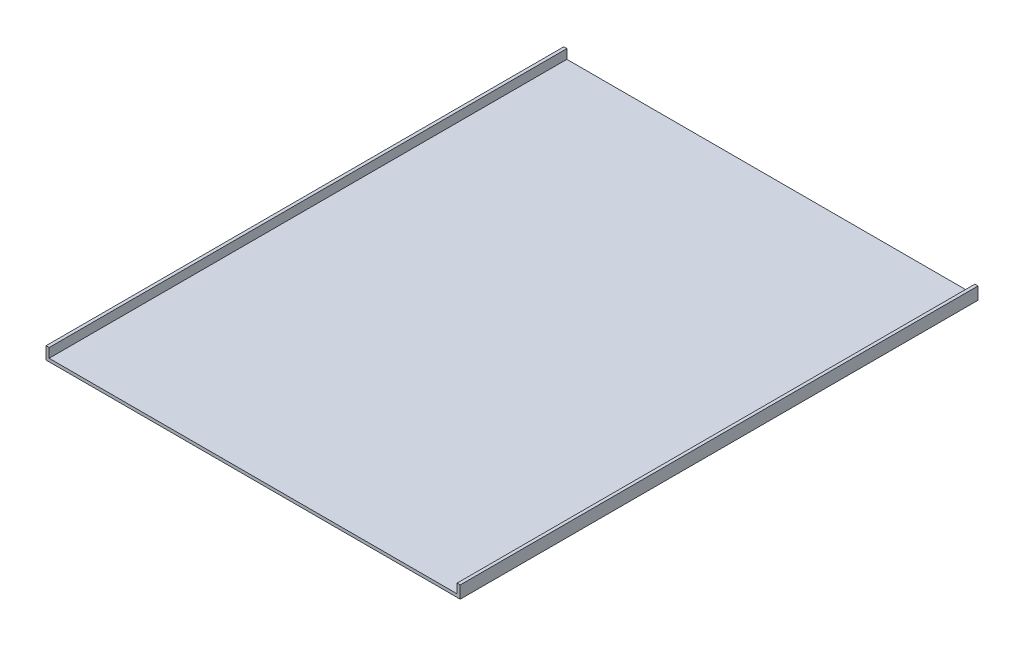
ISO-10303-21;
HEADER;
FILE_DESCRIPTION(('STEP AP214'),'2;1');
FILE_NAME('part.step','',(''),(''),'','','');
FILE_SCHEMA(('AUTOMOTIVE_DESIGN { 1 0 10303 214 1 1 1 1 }'));
ENDSEC;
DATA;
#1=APPLICATION_CONTEXT('core data for automotive mechanical design processes');
#2=APPLICATION_PROTOCOL_DEFINITION('international standard','automotive_design',2000,#1);
#3=PRODUCT_CONTEXT('',#1,'mechanical');
#4=PRODUCT('Part','Part','',(#3));
#5=PRODUCT_RELATED_PRODUCT_CATEGORY('part','',(#4));
#6=PRODUCT_DEFINITION_FORMATION('','',#4);
#7=PRODUCT_DEFINITION_CONTEXT('part definition',#1,'design');
#8=PRODUCT_DEFINITION('design','',#6,#7);
#9=PRODUCT_DEFINITION_SHAPE('','',#8);
#10=(LENGTH_UNIT() NAMED_UNIT(*) SI_UNIT(.MILLI.,.METRE.));
#11=(NAMED_UNIT(*) PLANE_ANGLE_UNIT() SI_UNIT($,.RADIAN.));
#12=(NAMED_UNIT(*) SI_UNIT($,.STERADIAN.) SOLID_ANGLE_UNIT());
#13=UNCERTAINTY_MEASURE_WITH_UNIT(LENGTH_MEASURE(1.E-05),#10,'distance_accuracy_value','');
#14=(GEOMETRIC_REPRESENTATION_CONTEXT(3) GLOBAL_UNCERTAINTY_ASSIGNED_CONTEXT((#13)) GLOBAL_UNIT_ASSIGNED_CONTEXT((#10,
#11,#12)) REPRESENTATION_CONTEXT('',''));
#15=CARTESIAN_POINT('',(0.,0.,0.));
#16=DIRECTION('',(0.,0.,1.));
#17=DIRECTION('',(1.,0.,0.));
#18=AXIS2_PLACEMENT_3D('',#15,#16,#17);
#19=CARTESIAN_POINT('',(400.,0.,500.));
#20=DIRECTION('',(-1.,0.,0.));
#21=DIRECTION('',(0.,0.,1.));
#22=AXIS2_PLACEMENT_3D('',#19,#20,#21);
#23=PLANE('',#22);
#24=DIRECTION('',(0.,1.,0.));
#25=VECTOR('',#24,1.);
#26=CARTESIAN_POINT('',(400.,0.,0.));
#27=LINE('',#26,#25);
#28=CARTESIAN_POINT('',(400.,0.,0.));
#29=VERTEX_POINT('',#28);
#30=CARTESIAN_POINT('',(400.,12.,0.));
#31=VERTEX_POINT('',#30);
#32=EDGE_CURVE('E128',#29,#31,#27,.T.);
#33=ORIENTED_EDGE('',*,*,#32,.T.);
#34=DIRECTION('',(0.,0.,-1.));
#35=VECTOR('',#34,1.);
#36=CARTESIAN_POINT('',(400.,12.,500.));
#37=LINE('',#36,#35);
#38=CARTESIAN_POINT('',(400.,12.,500.));
#39=VERTEX_POINT('',#38);
#40=EDGE_CURVE('E11',#39,#31,#37,.T.);
#41=ORIENTED_EDGE('',*,*,#40,.F.);
#42=DIRECTION('',(0.,1.,0.));
#43=VECTOR('',#42,1.);
#44=CARTESIAN_POINT('',(400.,0.,500.));
#45=LINE('',#44,#43);
#46=CARTESIAN_POINT('',(400.,0.,500.));
#47=VERTEX_POINT('',#46);
#48=EDGE_CURVE('E86',#47,#39,#45,.T.);
#49=ORIENTED_EDGE('',*,*,#48,.F.);
#50=DIRECTION('',(0.,0.,-1.));
#51=VECTOR('',#50,1.);
#52=CARTESIAN_POINT('',(400.,0.,500.));
#53=LINE('',#52,#51);
#54=EDGE_CURVE('E127',#47,#29,#53,.T.);
#55=ORIENTED_EDGE('',*,*,#54,.T.);
#56=EDGE_LOOP('',(#33,#41,#49,#55));
#57=FACE_BOUND('',#56,.T.);
#58=ADVANCED_FACE('F31',(#57),#23,.F.);
#59=CARTESIAN_POINT('',(397.,12.,500.));
#60=DIRECTION('',(0.,1.,0.));
#61=DIRECTION('',(0.,0.,1.));
#62=AXIS2_PLACEMENT_3D('',#59,#60,#61);
#63=PLANE('',#62);
#64=DIRECTION('',(1.,0.,0.));
#65=VECTOR('',#64,1.);
#66=CARTESIAN_POINT('',(397.,12.,0.));
#67=LINE('',#66,#65);
#68=CARTESIAN_POINT('',(397.,12.,0.));
#69=VERTEX_POINT('',#68);
#70=EDGE_CURVE('E131',#69,#31,#67,.T.);
#71=ORIENTED_EDGE('',*,*,#70,.F.);
#72=DIRECTION('',(0.,0.,-1.));
#73=VECTOR('',#72,1.);
#74=CARTESIAN_POINT('',(397.,12.,500.));
#75=LINE('',#74,#73);
#76=CARTESIAN_POINT('',(397.,12.,500.));
#77=VERTEX_POINT('',#76);
#78=EDGE_CURVE('E39',#77,#69,#75,.T.);
#79=ORIENTED_EDGE('',*,*,#78,.F.);
#80=DIRECTION('',(1.,0.,0.));
#81=VECTOR('',#80,1.);
#82=CARTESIAN_POINT('',(397.,12.,500.));
#83=LINE('',#82,#81);
#84=EDGE_CURVE('E170',#77,#39,#83,.T.);
#85=ORIENTED_EDGE('',*,*,#84,.T.);
#86=ORIENTED_EDGE('',*,*,#40,.T.);
#87=EDGE_LOOP('',(#71,#79,#85,#86));
#88=FACE_BOUND('',#87,.T.);
#89=ADVANCED_FACE('F161',(#88),#63,.T.);
#90=CARTESIAN_POINT('',(397.,0.,500.));
#91=DIRECTION('',(-1.,0.,0.));
#92=DIRECTION('',(0.,0.,1.));
#93=AXIS2_PLACEMENT_3D('',#90,#91,#92);
#94=PLANE('',#93);
#95=DIRECTION('',(0.,1.,0.));
#96=VECTOR('',#95,1.);
#97=CARTESIAN_POINT('',(397.,0.,0.));
#98=LINE('',#97,#96);
#99=CARTESIAN_POINT('',(397.,3.,0.));
#100=VERTEX_POINT('',#99);
#101=EDGE_CURVE('E134',#100,#69,#98,.T.);
#102=ORIENTED_EDGE('',*,*,#101,.F.);
#103=DIRECTION('',(0.,0.,-1.));
#104=VECTOR('',#103,1.);
#105=CARTESIAN_POINT('',(397.,3.,500.));
#106=LINE('',#105,#104);
#107=CARTESIAN_POINT('',(397.,3.,500.));
#108=VERTEX_POINT('',#107);
#109=EDGE_CURVE('E151',#108,#100,#106,.T.);
#110=ORIENTED_EDGE('',*,*,#109,.F.);
#111=DIRECTION('',(0.,1.,0.));
#112=VECTOR('',#111,1.);
#113=CARTESIAN_POINT('',(397.,0.,500.));
#114=LINE('',#113,#112);
#115=EDGE_CURVE('E158',#108,#77,#114,.T.);
#116=ORIENTED_EDGE('',*,*,#115,.T.);
#117=ORIENTED_EDGE('',*,*,#78,.T.);
#118=EDGE_LOOP('',(#102,#110,#116,#117));
#119=FACE_BOUND('',#118,.T.);
#120=ADVANCED_FACE('F156',(#119),#94,.T.);
#121=CARTESIAN_POINT('',(0.,3.,500.));
#122=DIRECTION('',(0.,1.,0.));
#123=DIRECTION('',(0.,0.,1.));
#124=AXIS2_PLACEMENT_3D('',#121,#122,#123);
#125=PLANE('',#124);
#126=DIRECTION('',(1.,0.,0.));
#127=VECTOR('',#126,1.);
#128=CARTESIAN_POINT('',(0.,3.,0.));
#129=LINE('',#128,#127);
#130=CARTESIAN_POINT('',(3.,3.,0.));
#131=VERTEX_POINT('',#130);
#132=EDGE_CURVE('E137',#131,#100,#129,.T.);
#133=ORIENTED_EDGE('',*,*,#132,.F.);
#134=DIRECTION('',(0.,0.,-1.));
#135=VECTOR('',#134,1.);
#136=CARTESIAN_POINT('',(3.,3.,500.));
#137=LINE('',#136,#135);
#138=CARTESIAN_POINT('',(3.,3.,500.));
#139=VERTEX_POINT('',#138);
#140=EDGE_CURVE('E149',#139,#131,#137,.T.);
#141=ORIENTED_EDGE('',*,*,#140,.F.);
#142=DIRECTION('',(1.,0.,0.));
#143=VECTOR('',#142,1.);
#144=CARTESIAN_POINT('',(0.,3.,500.));
#145=LINE('',#144,#143);
#146=EDGE_CURVE('E122',#139,#108,#145,.T.);
#147=ORIENTED_EDGE('',*,*,#146,.T.);
#148=ORIENTED_EDGE('',*,*,#109,.T.);
#149=EDGE_LOOP('',(#133,#141,#147,#148));
#150=FACE_BOUND('',#149,.T.);
#151=ADVANCED_FACE('F168',(#150),#125,.T.);
#152=CARTESIAN_POINT('',(3.,12.,500.));
#153=DIRECTION('',(1.,0.,0.));
#154=DIRECTION('',(0.,1.,0.));
#155=AXIS2_PLACEMENT_3D('',#152,#153,#154);
#156=PLANE('',#155);
#157=DIRECTION('',(0.,-1.,0.));
#158=VECTOR('',#157,1.);
#159=CARTESIAN_POINT('',(3.,12.,0.));
#160=LINE('',#159,#158);
#161=CARTESIAN_POINT('',(3.,12.,0.));
#162=VERTEX_POINT('',#161);
#163=EDGE_CURVE('E140',#162,#131,#160,.T.);
#164=ORIENTED_EDGE('',*,*,#163,.F.);
#165=DIRECTION('',(0.,0.,-1.));
#166=VECTOR('',#165,1.);
#167=CARTESIAN_POINT('',(3.,12.,500.));
#168=LINE('',#167,#166);
#169=CARTESIAN_POINT('',(3.,12.,500.));
#170=VERTEX_POINT('',#169);
#171=EDGE_CURVE('E110',#170,#162,#168,.T.);
#172=ORIENTED_EDGE('',*,*,#171,.F.);
#173=DIRECTION('',(0.,-1.,0.));
#174=VECTOR('',#173,1.);
#175=CARTESIAN_POINT('',(3.,12.,500.));
#176=LINE('',#175,#174);
#177=EDGE_CURVE('E120',#170,#139,#176,.T.);
#178=ORIENTED_EDGE('',*,*,#177,.T.);
#179=ORIENTED_EDGE('',*,*,#140,.T.);
#180=EDGE_LOOP('',(#164,#172,#178,#179));
#181=FACE_BOUND('',#180,.T.);
#182=ADVANCED_FACE('F175',(#181),#156,.T.);
#183=CARTESIAN_POINT('',(0.,12.,500.));
#184=DIRECTION('',(0.,1.,0.));
#185=DIRECTION('',(0.,0.,1.));
#186=AXIS2_PLACEMENT_3D('',#183,#184,#185);
#187=PLANE('',#186);
#188=DIRECTION('',(1.,0.,0.));
#189=VECTOR('',#188,1.);
#190=CARTESIAN_POINT('',(0.,12.,0.));
#191=LINE('',#190,#189);
#192=CARTESIAN_POINT('',(0.,12.,0.));
#193=VERTEX_POINT('',#192);
#194=EDGE_CURVE('E109',#193,#162,#191,.T.);
#195=ORIENTED_EDGE('',*,*,#194,.F.);
#196=DIRECTION('',(0.,0.,-1.));
#197=VECTOR('',#196,1.);
#198=CARTESIAN_POINT('',(0.,12.,500.));
#199=LINE('',#198,#197);
#200=CARTESIAN_POINT('',(0.,12.,500.));
#201=VERTEX_POINT('',#200);
#202=EDGE_CURVE('E103',#201,#193,#199,.T.);
#203=ORIENTED_EDGE('',*,*,#202,.F.);
#204=DIRECTION('',(1.,0.,0.));
#205=VECTOR('',#204,1.);
#206=CARTESIAN_POINT('',(0.,12.,500.));
#207=LINE('',#206,#205);
#208=EDGE_CURVE('E107',#201,#170,#207,.T.);
#209=ORIENTED_EDGE('',*,*,#208,.T.);
#210=ORIENTED_EDGE('',*,*,#171,.T.);
#211=EDGE_LOOP('',(#195,#203,#209,#210));
#212=FACE_BOUND('',#211,.T.);
#213=ADVANCED_FACE('F105',(#212),#187,.T.);
#214=CARTESIAN_POINT('',(0.,12.,500.));
#215=DIRECTION('',(1.,0.,0.));
#216=DIRECTION('',(0.,1.,0.));
#217=AXIS2_PLACEMENT_3D('',#214,#215,#216);
#218=PLANE('',#217);
#219=DIRECTION('',(0.,-1.,0.));
#220=VECTOR('',#219,1.);
#221=CARTESIAN_POINT('',(0.,12.,0.));
#222=LINE('',#221,#220);
#223=CARTESIAN_POINT('',(0.,0.,0.));
#224=VERTEX_POINT('',#223);
#225=EDGE_CURVE('E74',#193,#224,#222,.T.);
#226=ORIENTED_EDGE('',*,*,#225,.T.);
#227=DIRECTION('',(0.,0.,-1.));
#228=VECTOR('',#227,1.);
#229=CARTESIAN_POINT('',(0.,0.,500.));
#230=LINE('',#229,#228);
#231=CARTESIAN_POINT('',(0.,0.,500.));
#232=VERTEX_POINT('',#231);
#233=EDGE_CURVE('E111',#232,#224,#230,.T.);
#234=ORIENTED_EDGE('',*,*,#233,.F.);
#235=DIRECTION('',(0.,-1.,0.));
#236=VECTOR('',#235,1.);
#237=CARTESIAN_POINT('',(0.,12.,500.));
#238=LINE('',#237,#236);
#239=EDGE_CURVE('E113',#201,#232,#238,.T.);
#240=ORIENTED_EDGE('',*,*,#239,.F.);
#241=ORIENTED_EDGE('',*,*,#202,.T.);
#242=EDGE_LOOP('',(#226,#234,#240,#241));
#243=FACE_BOUND('',#242,.T.);
#244=ADVANCED_FACE('F114',(#243),#218,.F.);
#245=CARTESIAN_POINT('',(0.,0.,500.));
#246=DIRECTION('',(0.,1.,0.));
#247=DIRECTION('',(0.,0.,1.));
#248=AXIS2_PLACEMENT_3D('',#245,#246,#247);
#249=PLANE('',#248);
#250=DIRECTION('',(1.,0.,0.));
#251=VECTOR('',#250,1.);
#252=CARTESIAN_POINT('',(0.,0.,0.));
#253=LINE('',#252,#251);
#254=EDGE_CURVE('E80',#224,#29,#253,.T.);
#255=ORIENTED_EDGE('',*,*,#254,.T.);
#256=ORIENTED_EDGE('',*,*,#54,.F.);
#257=DIRECTION('',(1.,0.,0.));
#258=VECTOR('',#257,1.);
#259=CARTESIAN_POINT('',(0.,0.,500.));
#260=LINE('',#259,#258);
#261=EDGE_CURVE('E47',#232,#47,#260,.T.);
#262=ORIENTED_EDGE('',*,*,#261,.F.);
#263=ORIENTED_EDGE('',*,*,#233,.T.);
#264=EDGE_LOOP('',(#255,#256,#262,#263));
#265=FACE_BOUND('',#264,.T.);
#266=ADVANCED_FACE('F177',(#265),#249,.F.);
#267=CARTESIAN_POINT('',(400.,12.,500.));
#268=DIRECTION('',(0.,0.,-1.));
#269=DIRECTION('',(-1.,0.,0.));
#270=AXIS2_PLACEMENT_3D('',#267,#268,#269);
#271=PLANE('',#270);
#272=ORIENTED_EDGE('',*,*,#48,.T.);
#273=ORIENTED_EDGE('',*,*,#84,.F.);
#274=ORIENTED_EDGE('',*,*,#115,.F.);
#275=ORIENTED_EDGE('',*,*,#146,.F.);
#276=ORIENTED_EDGE('',*,*,#177,.F.);
#277=ORIENTED_EDGE('',*,*,#208,.F.);
#278=ORIENTED_EDGE('',*,*,#239,.T.);
#279=ORIENTED_EDGE('',*,*,#261,.T.);
#280=EDGE_LOOP('',(#272,#273,#274,#275,#276,#277,#278,#279));
#281=FACE_BOUND('',#280,.T.);
#282=ADVANCED_FACE('F117',(#281),#271,.F.);
#283=CARTESIAN_POINT('',(400.,12.,0.));
#284=DIRECTION('',(0.,0.,-1.));
#285=DIRECTION('',(-1.,0.,0.));
#286=AXIS2_PLACEMENT_3D('',#283,#284,#285);
#287=PLANE('',#286);
#288=ORIENTED_EDGE('',*,*,#32,.F.);
#289=ORIENTED_EDGE('',*,*,#254,.F.);
#290=ORIENTED_EDGE('',*,*,#225,.F.);
#291=ORIENTED_EDGE('',*,*,#194,.T.);
#292=ORIENTED_EDGE('',*,*,#163,.T.);
#293=ORIENTED_EDGE('',*,*,#132,.T.);
#294=ORIENTED_EDGE('',*,*,#101,.T.);
#295=ORIENTED_EDGE('',*,*,#70,.T.);
#296=EDGE_LOOP('',(#288,#289,#290,#291,#292,#293,#294,#295));
#297=FACE_BOUND('',#296,.T.);
#298=ADVANCED_FACE('F164',(#297),#287,.T.);
#299=CLOSED_SHELL('',(#58,#89,#120,#151,#182,#213,#244,#266,#282,#298));
#300=MANIFOLD_SOLID_BREP('B2',#299);
#301=ADVANCED_BREP_SHAPE_REPRESENTATION('',(#18,#300),#14);
#302=SHAPE_DEFINITION_REPRESENTATION(#9,#301);
ENDSEC;
END-ISO-10303-21;
